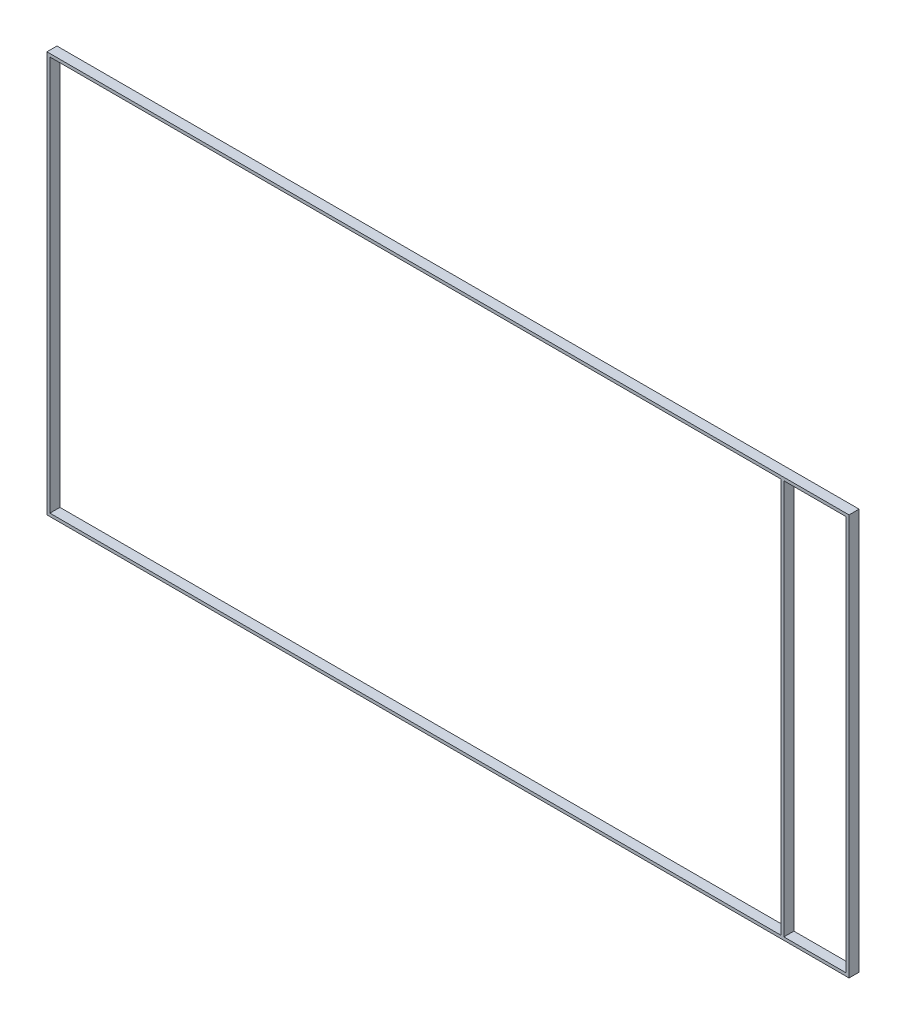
ISO-10303-21;
HEADER;
FILE_DESCRIPTION(('STEP AP214'),'2;1');
FILE_NAME('part.step','',(''),(''),'','','');
FILE_SCHEMA(('AUTOMOTIVE_DESIGN { 1 0 10303 214 1 1 1 1 }'));
ENDSEC;
DATA;
#1=APPLICATION_CONTEXT('core data for automotive mechanical design processes');
#2=APPLICATION_PROTOCOL_DEFINITION('international standard','automotive_design',2000,#1);
#3=PRODUCT_CONTEXT('',#1,'mechanical');
#4=PRODUCT('Part','Part','',(#3));
#5=PRODUCT_RELATED_PRODUCT_CATEGORY('part','',(#4));
#6=PRODUCT_DEFINITION_FORMATION('','',#4);
#7=PRODUCT_DEFINITION_CONTEXT('part definition',#1,'design');
#8=PRODUCT_DEFINITION('design','',#6,#7);
#9=PRODUCT_DEFINITION_SHAPE('','',#8);
#10=(LENGTH_UNIT() NAMED_UNIT(*) SI_UNIT(.MILLI.,.METRE.));
#11=(NAMED_UNIT(*) PLANE_ANGLE_UNIT() SI_UNIT($,.RADIAN.));
#12=(NAMED_UNIT(*) SI_UNIT($,.STERADIAN.) SOLID_ANGLE_UNIT());
#13=UNCERTAINTY_MEASURE_WITH_UNIT(LENGTH_MEASURE(1.E-05),#10,'distance_accuracy_value','');
#14=(GEOMETRIC_REPRESENTATION_CONTEXT(3) GLOBAL_UNCERTAINTY_ASSIGNED_CONTEXT((#13)) GLOBAL_UNIT_ASSIGNED_CONTEXT((#10,
#11,#12)) REPRESENTATION_CONTEXT('',''));
#15=CARTESIAN_POINT('',(0.,0.,0.));
#16=DIRECTION('',(0.,0.,1.));
#17=DIRECTION('',(1.,0.,0.));
#18=AXIS2_PLACEMENT_3D('',#15,#16,#17);
#19=CARTESIAN_POINT('',(2000.,-1000.,50.));
#20=DIRECTION('',(0.,0.,1.));
#21=DIRECTION('',(1.,0.,0.));
#22=AXIS2_PLACEMENT_3D('',#19,#20,#21);
#23=PLANE('',#22);
#24=DIRECTION('',(1.,0.,0.));
#25=VECTOR('',#24,1.);
#26=CARTESIAN_POINT('',(-1985.,-985.,50.));
#27=LINE('',#26,#25);
#28=CARTESIAN_POINT('',(-1985.,-985.,50.));
#29=VERTEX_POINT('',#28);
#30=CARTESIAN_POINT('',(1660.,-985.,50.));
#31=VERTEX_POINT('',#30);
#32=EDGE_CURVE('E158',#29,#31,#27,.T.);
#33=ORIENTED_EDGE('',*,*,#32,.F.);
#34=DIRECTION('',(0.,-1.,0.));
#35=VECTOR('',#34,1.);
#36=CARTESIAN_POINT('',(-1985.,985.,50.));
#37=LINE('',#36,#35);
#38=CARTESIAN_POINT('',(-1985.,985.,50.));
#39=VERTEX_POINT('',#38);
#40=EDGE_CURVE('E156',#39,#29,#37,.T.);
#41=ORIENTED_EDGE('',*,*,#40,.F.);
#42=DIRECTION('',(-1.,0.,0.));
#43=VECTOR('',#42,1.);
#44=CARTESIAN_POINT('',(-1985.,985.,50.));
#45=LINE('',#44,#43);
#46=CARTESIAN_POINT('',(1660.,985.,50.));
#47=VERTEX_POINT('',#46);
#48=EDGE_CURVE('E164',#47,#39,#45,.T.);
#49=ORIENTED_EDGE('',*,*,#48,.F.);
#50=DIRECTION('',(0.,1.,0.));
#51=VECTOR('',#50,1.);
#52=CARTESIAN_POINT('',(1660.,985.,50.));
#53=LINE('',#52,#51);
#54=EDGE_CURVE('E161',#31,#47,#53,.T.);
#55=ORIENTED_EDGE('',*,*,#54,.F.);
#56=EDGE_LOOP('',(#33,#41,#49,#55));
#57=FACE_BOUND('',#56,.T.);
#58=DIRECTION('',(0.,1.,0.));
#59=VECTOR('',#58,1.);
#60=CARTESIAN_POINT('',(2000.,1000.,50.));
#61=LINE('',#60,#59);
#62=CARTESIAN_POINT('',(2000.,-1000.,50.));
#63=VERTEX_POINT('',#62);
#64=CARTESIAN_POINT('',(2000.,1000.,50.));
#65=VERTEX_POINT('',#64);
#66=EDGE_CURVE('E187',#63,#65,#61,.T.);
#67=ORIENTED_EDGE('',*,*,#66,.T.);
#68=DIRECTION('',(-1.,0.,0.));
#69=VECTOR('',#68,1.);
#70=CARTESIAN_POINT('',(-2000.,1000.,50.));
#71=LINE('',#70,#69);
#72=CARTESIAN_POINT('',(-2000.,1000.,50.));
#73=VERTEX_POINT('',#72);
#74=EDGE_CURVE('E190',#65,#73,#71,.T.);
#75=ORIENTED_EDGE('',*,*,#74,.T.);
#76=DIRECTION('',(0.,-1.,0.));
#77=VECTOR('',#76,1.);
#78=CARTESIAN_POINT('',(-2000.,1000.,50.));
#79=LINE('',#78,#77);
#80=CARTESIAN_POINT('',(-2000.,-1000.,50.));
#81=VERTEX_POINT('',#80);
#82=EDGE_CURVE('E193',#73,#81,#79,.T.);
#83=ORIENTED_EDGE('',*,*,#82,.T.);
#84=DIRECTION('',(1.,0.,0.));
#85=VECTOR('',#84,1.);
#86=CARTESIAN_POINT('',(-2000.,-1000.,50.));
#87=LINE('',#86,#85);
#88=EDGE_CURVE('E195',#81,#63,#87,.T.);
#89=ORIENTED_EDGE('',*,*,#88,.T.);
#90=EDGE_LOOP('',(#67,#75,#83,#89));
#91=FACE_BOUND('',#90,.T.);
#92=DIRECTION('',(0.,-1.,0.));
#93=VECTOR('',#92,1.);
#94=CARTESIAN_POINT('',(1675.,985.,50.));
#95=LINE('',#94,#93);
#96=CARTESIAN_POINT('',(1675.,985.,50.));
#97=VERTEX_POINT('',#96);
#98=CARTESIAN_POINT('',(1675.,-985.,50.));
#99=VERTEX_POINT('',#98);
#100=EDGE_CURVE('E128',#97,#99,#95,.T.);
#101=ORIENTED_EDGE('',*,*,#100,.F.);
#102=DIRECTION('',(-1.,0.,0.));
#103=VECTOR('',#102,1.);
#104=CARTESIAN_POINT('',(1675.,985.,50.));
#105=LINE('',#104,#103);
#106=CARTESIAN_POINT('',(1985.,985.,50.));
#107=VERTEX_POINT('',#106);
#108=EDGE_CURVE('E120',#107,#97,#105,.T.);
#109=ORIENTED_EDGE('',*,*,#108,.F.);
#110=DIRECTION('',(0.,1.,0.));
#111=VECTOR('',#110,1.);
#112=CARTESIAN_POINT('',(1985.,985.,50.));
#113=LINE('',#112,#111);
#114=CARTESIAN_POINT('',(1985.,-985.,50.));
#115=VERTEX_POINT('',#114);
#116=EDGE_CURVE('E142',#115,#107,#113,.T.);
#117=ORIENTED_EDGE('',*,*,#116,.F.);
#118=DIRECTION('',(1.,0.,0.));
#119=VECTOR('',#118,1.);
#120=CARTESIAN_POINT('',(1675.,-985.,50.));
#121=LINE('',#120,#119);
#122=EDGE_CURVE('E140',#99,#115,#121,.T.);
#123=ORIENTED_EDGE('',*,*,#122,.F.);
#124=EDGE_LOOP('',(#101,#109,#117,#123));
#125=FACE_BOUND('',#124,.T.);
#126=ADVANCED_FACE('F31',(#57,#91,#125),#23,.T.);
#127=CARTESIAN_POINT('',(2000.,-1000.,0.));
#128=DIRECTION('',(0.,0.,1.));
#129=DIRECTION('',(1.,0.,0.));
#130=AXIS2_PLACEMENT_3D('',#127,#128,#129);
#131=PLANE('',#130);
#132=DIRECTION('',(0.,-1.,0.));
#133=VECTOR('',#132,1.);
#134=CARTESIAN_POINT('',(-1985.,985.,0.));
#135=LINE('',#134,#133);
#136=CARTESIAN_POINT('',(-1985.,985.,0.));
#137=VERTEX_POINT('',#136);
#138=CARTESIAN_POINT('',(-1985.,-985.,0.));
#139=VERTEX_POINT('',#138);
#140=EDGE_CURVE('E136',#137,#139,#135,.T.);
#141=ORIENTED_EDGE('',*,*,#140,.T.);
#142=DIRECTION('',(1.,0.,0.));
#143=VECTOR('',#142,1.);
#144=CARTESIAN_POINT('',(-1985.,-985.,0.));
#145=LINE('',#144,#143);
#146=CARTESIAN_POINT('',(1660.,-985.,0.));
#147=VERTEX_POINT('',#146);
#148=EDGE_CURVE('E169',#139,#147,#145,.T.);
#149=ORIENTED_EDGE('',*,*,#148,.T.);
#150=DIRECTION('',(0.,1.,0.));
#151=VECTOR('',#150,1.);
#152=CARTESIAN_POINT('',(1660.,985.,0.));
#153=LINE('',#152,#151);
#154=CARTESIAN_POINT('',(1660.,985.,0.));
#155=VERTEX_POINT('',#154);
#156=EDGE_CURVE('E172',#147,#155,#153,.T.);
#157=ORIENTED_EDGE('',*,*,#156,.T.);
#158=DIRECTION('',(-1.,0.,0.));
#159=VECTOR('',#158,1.);
#160=CARTESIAN_POINT('',(-1985.,985.,0.));
#161=LINE('',#160,#159);
#162=EDGE_CURVE('E159',#155,#137,#161,.T.);
#163=ORIENTED_EDGE('',*,*,#162,.T.);
#164=EDGE_LOOP('',(#141,#149,#157,#163));
#165=FACE_BOUND('',#164,.T.);
#166=DIRECTION('',(0.,1.,0.));
#167=VECTOR('',#166,1.);
#168=CARTESIAN_POINT('',(2000.,1000.,0.));
#169=LINE('',#168,#167);
#170=CARTESIAN_POINT('',(2000.,-1000.,0.));
#171=VERTEX_POINT('',#170);
#172=CARTESIAN_POINT('',(2000.,1000.,0.));
#173=VERTEX_POINT('',#172);
#174=EDGE_CURVE('E186',#171,#173,#169,.T.);
#175=ORIENTED_EDGE('',*,*,#174,.F.);
#176=DIRECTION('',(1.,0.,0.));
#177=VECTOR('',#176,1.);
#178=CARTESIAN_POINT('',(-2000.,-1000.,0.));
#179=LINE('',#178,#177);
#180=CARTESIAN_POINT('',(-2000.,-1000.,0.));
#181=VERTEX_POINT('',#180);
#182=EDGE_CURVE('E191',#181,#171,#179,.T.);
#183=ORIENTED_EDGE('',*,*,#182,.F.);
#184=DIRECTION('',(0.,-1.,0.));
#185=VECTOR('',#184,1.);
#186=CARTESIAN_POINT('',(-2000.,1000.,0.));
#187=LINE('',#186,#185);
#188=CARTESIAN_POINT('',(-2000.,1000.,0.));
#189=VERTEX_POINT('',#188);
#190=EDGE_CURVE('E202',#189,#181,#187,.T.);
#191=ORIENTED_EDGE('',*,*,#190,.F.);
#192=DIRECTION('',(-1.,0.,0.));
#193=VECTOR('',#192,1.);
#194=CARTESIAN_POINT('',(-2000.,1000.,0.));
#195=LINE('',#194,#193);
#196=EDGE_CURVE('E200',#173,#189,#195,.T.);
#197=ORIENTED_EDGE('',*,*,#196,.F.);
#198=EDGE_LOOP('',(#175,#183,#191,#197));
#199=FACE_BOUND('',#198,.T.);
#200=DIRECTION('',(-1.,0.,0.));
#201=VECTOR('',#200,1.);
#202=CARTESIAN_POINT('',(1675.,985.,0.));
#203=LINE('',#202,#201);
#204=CARTESIAN_POINT('',(1985.,985.,0.));
#205=VERTEX_POINT('',#204);
#206=CARTESIAN_POINT('',(1675.,985.,0.));
#207=VERTEX_POINT('',#206);
#208=EDGE_CURVE('E54',#205,#207,#203,.T.);
#209=ORIENTED_EDGE('',*,*,#208,.T.);
#210=DIRECTION('',(0.,-1.,0.));
#211=VECTOR('',#210,1.);
#212=CARTESIAN_POINT('',(1675.,985.,0.));
#213=LINE('',#212,#211);
#214=CARTESIAN_POINT('',(1675.,-985.,0.));
#215=VERTEX_POINT('',#214);
#216=EDGE_CURVE('E135',#207,#215,#213,.T.);
#217=ORIENTED_EDGE('',*,*,#216,.T.);
#218=DIRECTION('',(1.,0.,0.));
#219=VECTOR('',#218,1.);
#220=CARTESIAN_POINT('',(1675.,-985.,0.));
#221=LINE('',#220,#219);
#222=CARTESIAN_POINT('',(1985.,-985.,0.));
#223=VERTEX_POINT('',#222);
#224=EDGE_CURVE('E148',#215,#223,#221,.T.);
#225=ORIENTED_EDGE('',*,*,#224,.T.);
#226=DIRECTION('',(0.,1.,0.));
#227=VECTOR('',#226,1.);
#228=CARTESIAN_POINT('',(1985.,985.,0.));
#229=LINE('',#228,#227);
#230=EDGE_CURVE('E129',#223,#205,#229,.T.);
#231=ORIENTED_EDGE('',*,*,#230,.T.);
#232=EDGE_LOOP('',(#209,#217,#225,#231));
#233=FACE_BOUND('',#232,.T.);
#234=ADVANCED_FACE('F220',(#165,#199,#233),#131,.F.);
#235=CARTESIAN_POINT('',(2000.,1000.,50.));
#236=DIRECTION('',(-1.,0.,0.));
#237=DIRECTION('',(0.,-1.,0.));
#238=AXIS2_PLACEMENT_3D('',#235,#236,#237);
#239=PLANE('',#238);
#240=ORIENTED_EDGE('',*,*,#174,.T.);
#241=DIRECTION('',(0.,0.,-1.));
#242=VECTOR('',#241,1.);
#243=CARTESIAN_POINT('',(2000.,1000.,50.));
#244=LINE('',#243,#242);
#245=EDGE_CURVE('E11',#65,#173,#244,.T.);
#246=ORIENTED_EDGE('',*,*,#245,.F.);
#247=ORIENTED_EDGE('',*,*,#66,.F.);
#248=DIRECTION('',(0.,0.,-1.));
#249=VECTOR('',#248,1.);
#250=CARTESIAN_POINT('',(2000.,-1000.,50.));
#251=LINE('',#250,#249);
#252=EDGE_CURVE('E197',#63,#171,#251,.T.);
#253=ORIENTED_EDGE('',*,*,#252,.T.);
#254=EDGE_LOOP('',(#240,#246,#247,#253));
#255=FACE_BOUND('',#254,.T.);
#256=ADVANCED_FACE('F33',(#255),#239,.F.);
#257=CARTESIAN_POINT('',(-2000.,1000.,50.));
#258=DIRECTION('',(0.,-1.,0.));
#259=DIRECTION('',(0.,0.,-1.));
#260=AXIS2_PLACEMENT_3D('',#257,#258,#259);
#261=PLANE('',#260);
#262=ORIENTED_EDGE('',*,*,#196,.T.);
#263=DIRECTION('',(0.,0.,-1.));
#264=VECTOR('',#263,1.);
#265=CARTESIAN_POINT('',(-2000.,1000.,50.));
#266=LINE('',#265,#264);
#267=EDGE_CURVE('E39',#73,#189,#266,.T.);
#268=ORIENTED_EDGE('',*,*,#267,.F.);
#269=ORIENTED_EDGE('',*,*,#74,.F.);
#270=ORIENTED_EDGE('',*,*,#245,.T.);
#271=EDGE_LOOP('',(#262,#268,#269,#270));
#272=FACE_BOUND('',#271,.T.);
#273=ADVANCED_FACE('F230',(#272),#261,.F.);
#274=CARTESIAN_POINT('',(-2000.,1000.,50.));
#275=DIRECTION('',(1.,0.,0.));
#276=DIRECTION('',(0.,1.,0.));
#277=AXIS2_PLACEMENT_3D('',#274,#275,#276);
#278=PLANE('',#277);
#279=ORIENTED_EDGE('',*,*,#190,.T.);
#280=DIRECTION('',(0.,0.,-1.));
#281=VECTOR('',#280,1.);
#282=CARTESIAN_POINT('',(-2000.,-1000.,50.));
#283=LINE('',#282,#281);
#284=EDGE_CURVE('E207',#81,#181,#283,.T.);
#285=ORIENTED_EDGE('',*,*,#284,.F.);
#286=ORIENTED_EDGE('',*,*,#82,.F.);
#287=ORIENTED_EDGE('',*,*,#267,.T.);
#288=EDGE_LOOP('',(#279,#285,#286,#287));
#289=FACE_BOUND('',#288,.T.);
#290=ADVANCED_FACE('F214',(#289),#278,.F.);
#291=CARTESIAN_POINT('',(-2000.,-1000.,50.));
#292=DIRECTION('',(0.,1.,0.));
#293=DIRECTION('',(0.,0.,1.));
#294=AXIS2_PLACEMENT_3D('',#291,#292,#293);
#295=PLANE('',#294);
#296=ORIENTED_EDGE('',*,*,#182,.T.);
#297=ORIENTED_EDGE('',*,*,#252,.F.);
#298=ORIENTED_EDGE('',*,*,#88,.F.);
#299=ORIENTED_EDGE('',*,*,#284,.T.);
#300=EDGE_LOOP('',(#296,#297,#298,#299));
#301=FACE_BOUND('',#300,.T.);
#302=ADVANCED_FACE('F224',(#301),#295,.F.);
#303=CARTESIAN_POINT('',(-1985.,985.,50.));
#304=DIRECTION('',(1.,0.,0.));
#305=DIRECTION('',(0.,1.,0.));
#306=AXIS2_PLACEMENT_3D('',#303,#304,#305);
#307=PLANE('',#306);
#308=ORIENTED_EDGE('',*,*,#140,.F.);
#309=DIRECTION('',(0.,0.,-1.));
#310=VECTOR('',#309,1.);
#311=CARTESIAN_POINT('',(-1985.,985.,50.));
#312=LINE('',#311,#310);
#313=EDGE_CURVE('E166',#39,#137,#312,.T.);
#314=ORIENTED_EDGE('',*,*,#313,.F.);
#315=ORIENTED_EDGE('',*,*,#40,.T.);
#316=DIRECTION('',(0.,0.,-1.));
#317=VECTOR('',#316,1.);
#318=CARTESIAN_POINT('',(-1985.,-985.,50.));
#319=LINE('',#318,#317);
#320=EDGE_CURVE('E183',#29,#139,#319,.T.);
#321=ORIENTED_EDGE('',*,*,#320,.T.);
#322=EDGE_LOOP('',(#308,#314,#315,#321));
#323=FACE_BOUND('',#322,.T.);
#324=ADVANCED_FACE('F247',(#323),#307,.T.);
#325=CARTESIAN_POINT('',(-1985.,-985.,50.));
#326=DIRECTION('',(0.,1.,0.));
#327=DIRECTION('',(-1.,0.,0.));
#328=AXIS2_PLACEMENT_3D('',#325,#326,#327);
#329=PLANE('',#328);
#330=ORIENTED_EDGE('',*,*,#148,.F.);
#331=ORIENTED_EDGE('',*,*,#320,.F.);
#332=ORIENTED_EDGE('',*,*,#32,.T.);
#333=DIRECTION('',(0.,0.,-1.));
#334=VECTOR('',#333,1.);
#335=CARTESIAN_POINT('',(1660.,-985.,50.));
#336=LINE('',#335,#334);
#337=EDGE_CURVE('E181',#31,#147,#336,.T.);
#338=ORIENTED_EDGE('',*,*,#337,.T.);
#339=EDGE_LOOP('',(#330,#331,#332,#338));
#340=FACE_BOUND('',#339,.T.);
#341=ADVANCED_FACE('F254',(#340),#329,.T.);
#342=CARTESIAN_POINT('',(1660.,985.,50.));
#343=DIRECTION('',(-1.,0.,0.));
#344=DIRECTION('',(0.,-1.,0.));
#345=AXIS2_PLACEMENT_3D('',#342,#343,#344);
#346=PLANE('',#345);
#347=ORIENTED_EDGE('',*,*,#156,.F.);
#348=ORIENTED_EDGE('',*,*,#337,.F.);
#349=ORIENTED_EDGE('',*,*,#54,.T.);
#350=DIRECTION('',(0.,0.,-1.));
#351=VECTOR('',#350,1.);
#352=CARTESIAN_POINT('',(1660.,985.,50.));
#353=LINE('',#352,#351);
#354=EDGE_CURVE('E179',#47,#155,#353,.T.);
#355=ORIENTED_EDGE('',*,*,#354,.T.);
#356=EDGE_LOOP('',(#347,#348,#349,#355));
#357=FACE_BOUND('',#356,.T.);
#358=ADVANCED_FACE('F259',(#357),#346,.T.);
#359=CARTESIAN_POINT('',(-1985.,985.,50.));
#360=DIRECTION('',(0.,-1.,0.));
#361=DIRECTION('',(0.,0.,-1.));
#362=AXIS2_PLACEMENT_3D('',#359,#360,#361);
#363=PLANE('',#362);
#364=ORIENTED_EDGE('',*,*,#162,.F.);
#365=ORIENTED_EDGE('',*,*,#354,.F.);
#366=ORIENTED_EDGE('',*,*,#48,.T.);
#367=ORIENTED_EDGE('',*,*,#313,.T.);
#368=EDGE_LOOP('',(#364,#365,#366,#367));
#369=FACE_BOUND('',#368,.T.);
#370=ADVANCED_FACE('F266',(#369),#363,.T.);
#371=CARTESIAN_POINT('',(1675.,985.,50.));
#372=DIRECTION('',(0.,-1.,0.));
#373=DIRECTION('',(0.,0.,-1.));
#374=AXIS2_PLACEMENT_3D('',#371,#372,#373);
#375=PLANE('',#374);
#376=ORIENTED_EDGE('',*,*,#208,.F.);
#377=DIRECTION('',(0.,0.,-1.));
#378=VECTOR('',#377,1.);
#379=CARTESIAN_POINT('',(1985.,985.,50.));
#380=LINE('',#379,#378);
#381=EDGE_CURVE('E124',#107,#205,#380,.T.);
#382=ORIENTED_EDGE('',*,*,#381,.F.);
#383=ORIENTED_EDGE('',*,*,#108,.T.);
#384=DIRECTION('',(0.,0.,-1.));
#385=VECTOR('',#384,1.);
#386=CARTESIAN_POINT('',(1675.,985.,50.));
#387=LINE('',#386,#385);
#388=EDGE_CURVE('E123',#97,#207,#387,.T.);
#389=ORIENTED_EDGE('',*,*,#388,.T.);
#390=EDGE_LOOP('',(#376,#382,#383,#389));
#391=FACE_BOUND('',#390,.T.);
#392=ADVANCED_FACE('F122',(#391),#375,.T.);
#393=CARTESIAN_POINT('',(1675.,985.,50.));
#394=DIRECTION('',(1.,0.,0.));
#395=DIRECTION('',(0.,1.,0.));
#396=AXIS2_PLACEMENT_3D('',#393,#394,#395);
#397=PLANE('',#396);
#398=ORIENTED_EDGE('',*,*,#216,.F.);
#399=ORIENTED_EDGE('',*,*,#388,.F.);
#400=ORIENTED_EDGE('',*,*,#100,.T.);
#401=DIRECTION('',(0.,0.,-1.));
#402=VECTOR('',#401,1.);
#403=CARTESIAN_POINT('',(1675.,-985.,50.));
#404=LINE('',#403,#402);
#405=EDGE_CURVE('E137',#99,#215,#404,.T.);
#406=ORIENTED_EDGE('',*,*,#405,.T.);
#407=EDGE_LOOP('',(#398,#399,#400,#406));
#408=FACE_BOUND('',#407,.T.);
#409=ADVANCED_FACE('F132',(#408),#397,.T.);
#410=CARTESIAN_POINT('',(1675.,-985.,50.));
#411=DIRECTION('',(0.,1.,0.));
#412=DIRECTION('',(-1.,0.,0.));
#413=AXIS2_PLACEMENT_3D('',#410,#411,#412);
#414=PLANE('',#413);
#415=ORIENTED_EDGE('',*,*,#224,.F.);
#416=ORIENTED_EDGE('',*,*,#405,.F.);
#417=ORIENTED_EDGE('',*,*,#122,.T.);
#418=DIRECTION('',(0.,0.,-1.));
#419=VECTOR('',#418,1.);
#420=CARTESIAN_POINT('',(1985.,-985.,50.));
#421=LINE('',#420,#419);
#422=EDGE_CURVE('E46',#115,#223,#421,.T.);
#423=ORIENTED_EDGE('',*,*,#422,.T.);
#424=EDGE_LOOP('',(#415,#416,#417,#423));
#425=FACE_BOUND('',#424,.T.);
#426=ADVANCED_FACE('F283',(#425),#414,.T.);
#427=CARTESIAN_POINT('',(1985.,985.,50.));
#428=DIRECTION('',(-1.,0.,0.));
#429=DIRECTION('',(0.,-1.,0.));
#430=AXIS2_PLACEMENT_3D('',#427,#428,#429);
#431=PLANE('',#430);
#432=ORIENTED_EDGE('',*,*,#230,.F.);
#433=ORIENTED_EDGE('',*,*,#422,.F.);
#434=ORIENTED_EDGE('',*,*,#116,.T.);
#435=ORIENTED_EDGE('',*,*,#381,.T.);
#436=EDGE_LOOP('',(#432,#433,#434,#435));
#437=FACE_BOUND('',#436,.T.);
#438=ADVANCED_FACE('F286',(#437),#431,.T.);
#439=CLOSED_SHELL('',(#126,#234,#256,#273,#290,#302,#324,#341,#358,#370,#392,#409,#426,#438));
#440=MANIFOLD_SOLID_BREP('B2',#439);
#441=ADVANCED_BREP_SHAPE_REPRESENTATION('',(#18,#440),#14);
#442=SHAPE_DEFINITION_REPRESENTATION(#9,#441);
ENDSEC;
END-ISO-10303-21;
